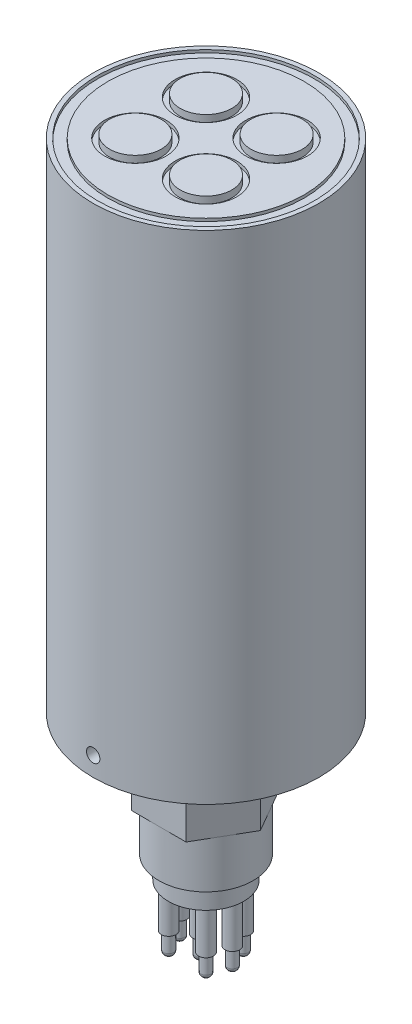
from build123d import *

# Parameters (mm, degrees)
SKETCH1_R                 = 22.86
BOSS_EXTRUDE1_DEPTH       = 100.584
SKETCH2_R                 = 21.9456
SKETCH2_R_2               = 19.8628
CUT_EXTRUDE1_DEPTH        = 0.5842
SKETCH4_R                 = 6.25475
CUT_EXTRUDE4_DEPTH        = 0.7112
SKETCH5_R                 = 5.2324
BOSS_EXTRUDE2_DEPTH       = 1.397
BOSS_EXTRUDE3_DEPTH       = 15.24
SKETCH8_R                 = 9.525
BOSS_EXTRUDE4_DEPTH       = 9.525
SKETCH9_R                 = 7.62
BOSS_EXTRUDE5_DEPTH       = 4.572
SKETCH10_R                = 1.4859
BOSS_EXTRUDE6_DEPTH       = 8.89
SKETCH12_R                = 1.016
BOSS_EXTRUDE7_DEPTH       = 4.318
FILLET4_R                 = 0.9525
CIRPATTERN1_COUNT         = 7
CIRPATTERN1_ANGLE         = 270
FILLET4_OF_CIRPATTERN1_R  = 0.9525
LPATTERN2_COUNT           = 2
LPATTERN2_PITCH           = 3.7719
LPATTERN2_COUNT_DIR2      = 2
LPATTERN2_PITCH_DIR2      = 2.54
FILLET4_OF_LPATTERN2_R    = 0.9525
F_6_32_TAPPED_HOLE1_D     = 2.7051
F_6_32_TAPPED_HOLE1_DEPTH = 9.398
F_6_32_TAPPED_HOLE1_TIP   = 0.81269403
F_6_32_TAPPED_HOLE2_D     = 2.7051
F_6_32_TAPPED_HOLE2_DEPTH = 9.398
F_6_32_TAPPED_HOLE2_TIP   = 0.81269403


with BuildPart() as part:
    # Sketch1 → Boss-Extrude1 (new body)
    with BuildSketch(Plane(origin=(0, 0, 0), x_dir=(1, 0, 0), z_dir=(0, 1, 0))):
        with Locations(Location((0, 0, 0), (0, 0, 270))):
            Circle(SKETCH1_R)
    extrude(amount=BOSS_EXTRUDE1_DEPTH)

    # Sketch2 → Cut-Extrude1 (cut)
    with BuildSketch(Plane(origin=(0, 100.584, 0), x_dir=(1, 0, 0), z_dir=(0, 1, 0))):
        with Locations(Location((0, 0, 0), (0, 0, 270))):
            Circle(SKETCH2_R)
        with Locations(Location((0, 0, 0), (0, 0, 270))):
            Circle(SKETCH2_R_2, mode=Mode.SUBTRACT)
    extrude(amount=-CUT_EXTRUDE1_DEPTH, mode=Mode.SUBTRACT)

    # Sketch4 → Cut-Extrude4 (cut)
    with BuildSketch(Plane(origin=(0, 100.584, 0), x_dir=(1, 0, 0), z_dir=(0, 1, 0))):
        with Locations(Location((-7.14375, 7.14375, 0), (0, 0, 270))):
            Circle(SKETCH4_R)
        with Locations(Location((7.14375, 7.14375, 0), (0, 0, 90))):
            Circle(SKETCH4_R)
        with Locations(Location((7.14375, -7.14375, 0), (0, 0, 270))):
            Circle(SKETCH4_R)
        with Locations(Location((-7.14375, -7.14375, 0), (0, 0, 90))):
            Circle(SKETCH4_R)
    extrude(amount=-CUT_EXTRUDE4_DEPTH, mode=Mode.SUBTRACT)

    # Sketch5 → Boss-Extrude2 (add)
    with BuildSketch(Plane(origin=(0, 99.8728, 0), x_dir=(1, 0, 0), z_dir=(0, 1, 0))):
        with Locations(Location((-7.14375, 7.14375, 0), (0, 0, 270))):
            Circle(SKETCH5_R)
        with Locations(Location((7.14375, 7.14375, 0), (0, 0, 90))):
            Circle(SKETCH5_R)
        with Locations(Location((7.14375, -7.14375, 0), (0, 0, 270))):
            Circle(SKETCH5_R)
        with Locations(Location((-7.14375, -7.14375, 0), (0, 0, 90))):
            Circle(SKETCH5_R)
    extrude(amount=BOSS_EXTRUDE2_DEPTH)

    # Sketch7 → Boss-Extrude3 (add)
    with BuildSketch(Plane.XZ):
        Polygon((5.499261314, 9.525), (-5.499261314, 9.525), (-10.998522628, 0), (-5.499261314, -9.525), (5.499261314, -9.525), (10.998522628, 0), align=None)
    extrude(amount=BOSS_EXTRUDE3_DEPTH)

    # Sketch8 → Boss-Extrude4 (add)
    with BuildSketch(Plane.XZ.offset(15.24)):
        with Locations(Location((0, 0, 0), (0, 0, 270))):
            Circle(SKETCH8_R)
    extrude(amount=BOSS_EXTRUDE4_DEPTH)

    # Sketch9 → Boss-Extrude5 (add)
    with BuildSketch(Plane.XZ.offset(24.765)):
        with Locations(Location((0, 0, 0), (0, 0, 270))):
            Circle(SKETCH9_R)
    extrude(amount=BOSS_EXTRUDE5_DEPTH)

    # Sketch10 → Boss-Extrude6 (add)
    with BuildSketch(Plane.XZ.offset(29.337)):
        with Locations(Location((3.771707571, 3.771707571, 0), (0, 0, 270))):
            Circle(SKETCH10_R)
    boss_extrude6 = extrude(amount=BOSS_EXTRUDE6_DEPTH)

    # Sketch12 → Boss-Extrude7 (add)
    with BuildSketch(Plane.XZ.offset(38.227)):
        with Locations(Location((3.771707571, 3.771707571, 0), (0, 0, 270))):
            Circle(SKETCH12_R)
    boss_extrude7 = extrude(amount=BOSS_EXTRUDE7_DEPTH)

    # Fillet4
    fillet4_edges = [part.edges().sort_by_distance(p)[0] for p in [
        (3.771707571, -42.545, 4.787707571),
    ]]
    fillet(fillet4_edges, radius=FILLET4_R)

    # CirPattern1: Boss-Extrude6, Boss-Extrude7 ×7 about axis
    cirpattern1_axis = Axis((0, 0, 0), (0, 1, 0))
    add([boss_extrude6.rotate(cirpattern1_axis, i * CIRPATTERN1_ANGLE / (CIRPATTERN1_COUNT - 1)) for i in range(1, CIRPATTERN1_COUNT)])
    add([boss_extrude7.rotate(cirpattern1_axis, i * CIRPATTERN1_ANGLE / (CIRPATTERN1_COUNT - 1)) for i in range(1, CIRPATTERN1_COUNT)])

    # Fillet4 of CirPattern1
    fillet4_of_cirpattern1_edges = [part.edges().sort_by_distance(p)[0] for p in [
        (6.05242049, -42.545, 0.71842049),
        (4.787707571, -42.545, -3.771707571),
        (0.71842049, -42.545, -6.05242049),
        (-3.771707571, -42.545, -4.787707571),
        (-6.05242049, -42.545, -0.71842049),
        (-4.787707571, -42.545, 3.771707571),
    ]]
    fillet(fillet4_of_cirpattern1_edges, radius=FILLET4_OF_CIRPATTERN1_R)

    # LPattern2: Boss-Extrude6, Boss-Extrude7 2 × 2, 2 skipped
    with Locations(*[(-i * LPATTERN2_PITCH, 0, -j * LPATTERN2_PITCH_DIR2) for i in range(LPATTERN2_COUNT) for j in range(LPATTERN2_COUNT_DIR2) if (i, j) not in ((0, 0), (0, 1), (1, 0))]):
        add(boss_extrude6)
        add(boss_extrude7)

    # Fillet4 of LPattern2
    fillet4_of_lpattern2_edges = [part.edges().sort_by_distance(p)[0] for p in [
        (-0.000192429, -42.545, 2.247707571),
    ]]
    fillet(fillet4_of_lpattern2_edges, radius=FILLET4_OF_LPATTERN2_R)

    # 6-32 Tapped Hole1
    with Locations(Plane.ZY.offset(22.86)):
        with Locations((0, 67.818)):
            Hole(F_6_32_TAPPED_HOLE1_D / 2, depth=F_6_32_TAPPED_HOLE1_DEPTH)
            with Locations((0, 0, -(F_6_32_TAPPED_HOLE1_DEPTH + F_6_32_TAPPED_HOLE1_TIP / 2))):  # 118° drill point
                Cone(0, F_6_32_TAPPED_HOLE1_D / 2, F_6_32_TAPPED_HOLE1_TIP, mode=Mode.SUBTRACT)

    # 6-32 Tapped Hole2
    with Locations(Plane.XY.offset(22.86)):
        with Locations((0, 3.9)):
            Hole(F_6_32_TAPPED_HOLE2_D / 2, depth=F_6_32_TAPPED_HOLE2_DEPTH)
            with Locations((0, 0, -(F_6_32_TAPPED_HOLE2_DEPTH + F_6_32_TAPPED_HOLE2_TIP / 2))):  # 118° drill point
                Cone(0, F_6_32_TAPPED_HOLE2_D / 2, F_6_32_TAPPED_HOLE2_TIP, mode=Mode.SUBTRACT)


solid = part.part
